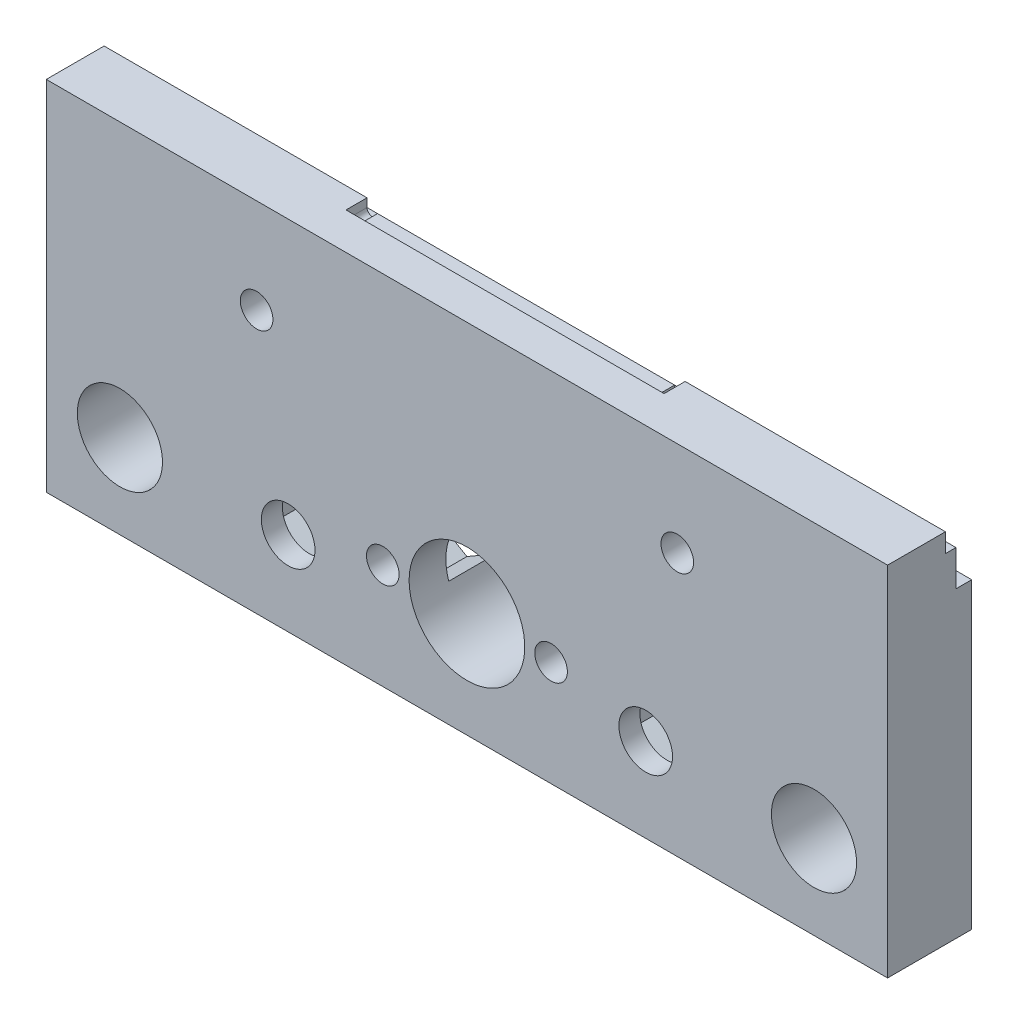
from build123d import *

# Parameters (mm, degrees)
SKETCH_2_W           = 80
SKETCH_2_H           = 34
SKETCH_2_R           = 4.05
EXTRUDE_1_DEPTH      = 8
SKETCH_3_R           = 2.55
CUT_EXTRUDE_1_DEPTH  = 88.292611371
CUT_EXTRUDE_2_DEPTH  = 88.292611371
SKETCH_5_R           = 1.55
CUT_EXTRUDE_3_DEPTH  = 88.292611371
CUT_EXTRUDE_5_DEPTH  = 4.5
SKETCH_11_R          = 1.55
CUT_EXTRUDE_7_DEPTH  = 88.292611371
CUT_EXTRUDE_11_DEPTH = 2
CUT_EXTRUDE_13_DEPTH = 6
SKETCH_20_R          = 5.5
CUT_EXTRUDE_14_DEPTH = 88.292611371


with BuildPart() as part:
    # Sketch 2 → Extrude 1 (new body)
    with BuildSketch(Plane.XY):
        with Locations((40, 17)):
            Rectangle(SKETCH_2_W, SKETCH_2_H)
        with Locations((7, 8)):
            Circle(SKETCH_2_R, mode=Mode.SUBTRACT)
        with Locations((40, 10)):
            Circle(SKETCH_2_R, mode=Mode.SUBTRACT)
        with Locations((73, 8)):
            Circle(SKETCH_2_R, mode=Mode.SUBTRACT)
    extrude(amount=EXTRUDE_1_DEPTH)

    # Sketch 3 → Cut-Extrude 1 (cut, through all)
    with BuildSketch(Plane.XY.offset(8)):
        with Locations((23, 8)):
            Circle(SKETCH_3_R)
        with Locations((57, 8)):
            Circle(SKETCH_3_R)
    extrude(amount=-CUT_EXTRUDE_1_DEPTH, mode=Mode.SUBTRACT)

    # Sketch 4 → Cut-Extrude 2 (cut, through all)
    with BuildSketch(Plane(origin=(80, 0, 0), x_dir=(0, 0, -1), z_dir=(1, 0, 0))):
        Polygon((-1.5, 32.2), (-2.5, 32.2), (-2.5, 34), (0, 34), (0, 28.8), (-1.5, 28.8), align=None)
    extrude(amount=-CUT_EXTRUDE_2_DEPTH, mode=Mode.SUBTRACT)

    # Sketch 5 → Cut-Extrude 3 (cut, through all)
    with BuildSketch(Plane.XY.offset(8)):
        with Locations((48, 10)):
            Circle(SKETCH_5_R)
        with Locations((32, 10)):
            Circle(SKETCH_5_R)
    extrude(amount=-CUT_EXTRUDE_3_DEPTH, mode=Mode.SUBTRACT)

    # Sketch 8 → Cut-Extrude 5 (cut)
    with BuildSketch(Plane(origin=(0, 0, 0), x_dir=(-1, 0, 0), z_dir=(0, 0, -1))):
        Polygon((-45.15, 8.354551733), (-45.15, 11.645448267), (-48, 13.290896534), (-50.85, 11.645448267), (-50.85, 8.354551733), (-48, 6.709103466), align=None)
        Polygon((-29.15, 8.354551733), (-29.15, 11.645448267), (-32, 13.290896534), (-34.85, 11.645448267), (-34.85, 8.354551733), (-32, 6.709103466), align=None)
    extrude(amount=-CUT_EXTRUDE_5_DEPTH, mode=Mode.SUBTRACT)

    # Sketch 11 → Cut-Extrude 7 (cut, through all)
    with BuildSketch(Plane(origin=(0, 0, 0), x_dir=(-1, 0, 0), z_dir=(0, 0, -1))):
        with Locations((-60, 25)):
            Circle(SKETCH_11_R)
        with Locations((-20, 25)):
            Circle(SKETCH_11_R)
    extrude(amount=-CUT_EXTRUDE_7_DEPTH, mode=Mode.SUBTRACT)

    # Sketch 19 → Cut-Extrude 11 (cut)
    with BuildSketch(Plane(origin=(0, 0, 2.5), x_dir=(-1, 0, 0), z_dir=(0, 0, -1))):
        with BuildLine():
            Line((-25, 34), (-55.247938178, 34))
            Line((-55.247938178, 34), (-55.247938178, 33.2))
            ThreePointArc((-55.247938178, 33.2), (-54.747938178, 32.7), (-54.247938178, 33.2))
            Line((-54.247938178, 33.2), (-26, 33.2))
            ThreePointArc((-26, 33.2), (-25.5, 32.7), (-25, 33.2))
            Line((-25, 33.2), (-25, 34))
        make_face()
    extrude(amount=-CUT_EXTRUDE_11_DEPTH, mode=Mode.SUBTRACT)

    # Sketch 7 → Cut-Extrude 13 (cut)
    with BuildSketch(Plane(origin=(0, 0, 0), x_dir=(-1, 0, 0), z_dir=(0, 0, -1))):
        Polygon((-52.9, 5.632863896), (-52.9, 10.367136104), (-57, 12.734272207), (-61.1, 10.367136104), (-61.1, 5.632863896), (-57, 3.265727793), align=None)
        Polygon((-18.9, 5.632863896), (-18.9, 10.367136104), (-23, 12.734272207), (-27.1, 10.367136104), (-27.1, 5.632863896), (-23, 3.265727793), align=None)
    extrude(amount=-CUT_EXTRUDE_13_DEPTH, mode=Mode.SUBTRACT)

    # Sketch 20 → Cut-Extrude 14 (cut, through all)
    with BuildSketch(Plane(origin=(0, 0, 0), x_dir=(-1, 0, 0), z_dir=(0, 0, -1))):
        with Locations((-40, 10)):
            Circle(SKETCH_20_R)
    extrude(amount=-CUT_EXTRUDE_14_DEPTH, mode=Mode.SUBTRACT)


solid = part.part
